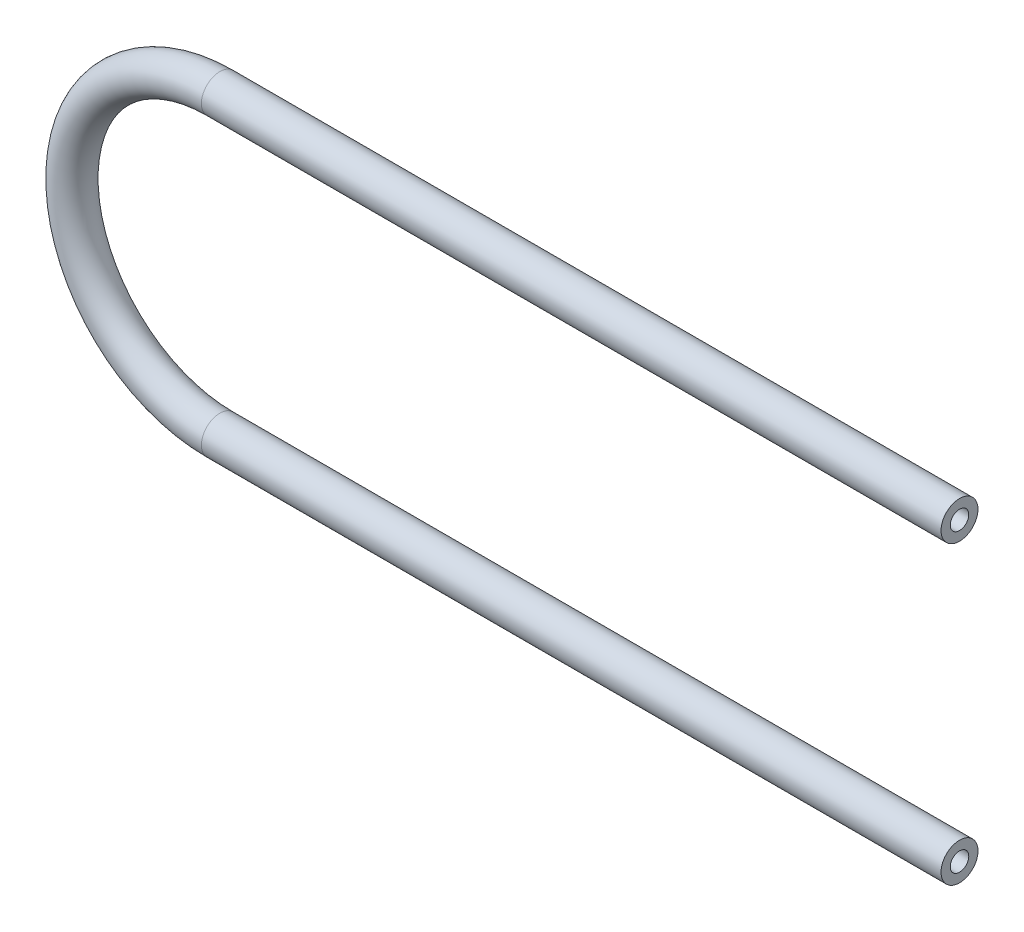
from build123d import *

# Parameters (mm, degrees)
SKETCH1_R                    = 3.175
SKETCH1_R_2                  = 1.5875
HOLLOW_180_DEGREE_BEND_ANGLE = 180
SKETCH2_R                    = 3.175
SKETCH2_R_2                  = 1.5875
HOLLOW_UPRIGHT_DEPTH         = 127
SKETCH3_R                    = 3.175
SKETCH3_R_2                  = 1.5875
BOSS_EXTRUDE2_DEPTH          = 127


with BuildPart() as part:
    # Sketch1 → Hollow_180_degree_bend (revolve)
    with BuildSketch(Plane.YZ):
        with Locations((25.4, 0)):
            Circle(SKETCH1_R)
        with Locations((25.4, 0)):
            Circle(SKETCH1_R_2, mode=Mode.SUBTRACT)
    revolve(axis=Axis((0, 0, -50.8), (0, 0, 1)), revolution_arc=HOLLOW_180_DEGREE_BEND_ANGLE)

    # Sketch2 → Hollow_upright (add)
    with BuildSketch(Plane.YZ):
        with Locations(Location((-25.4, 0, 0), (0, 0, 180))):
            Circle(SKETCH2_R)
        with Locations(Location((-25.4, 0, 0), (0, 0, 180))):
            Circle(SKETCH2_R_2, mode=Mode.SUBTRACT)
    extrude(amount=HOLLOW_UPRIGHT_DEPTH)

    # Sketch3 → Boss-Extrude2 (add)
    with BuildSketch(Plane.YZ):
        with Locations((25.4, 0)):
            Circle(SKETCH3_R)
        with Locations((25.4, 0)):
            Circle(SKETCH3_R_2, mode=Mode.SUBTRACT)
    extrude(amount=BOSS_EXTRUDE2_DEPTH)


solid = part.part
